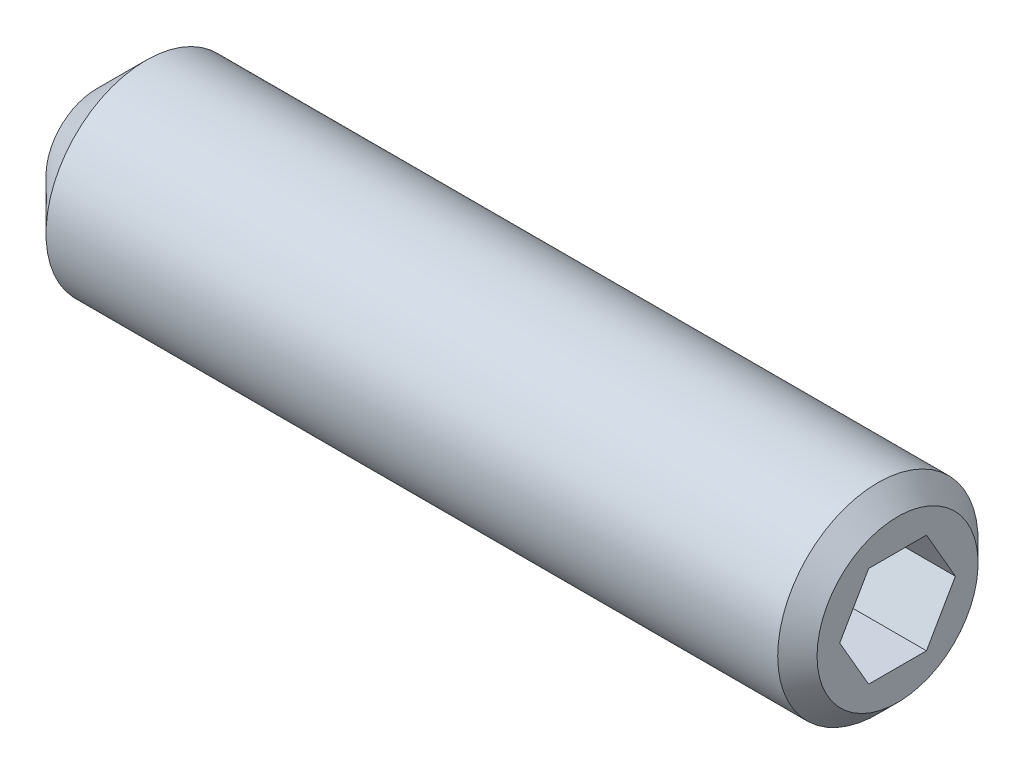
ISO-10303-21;
HEADER;
FILE_DESCRIPTION(('STEP AP214'),'2;1');
FILE_NAME('part.step','',(''),(''),'','','');
FILE_SCHEMA(('AUTOMOTIVE_DESIGN { 1 0 10303 214 1 1 1 1 }'));
ENDSEC;
DATA;
#1=APPLICATION_CONTEXT('core data for automotive mechanical design processes');
#2=APPLICATION_PROTOCOL_DEFINITION('international standard','automotive_design',2000,#1);
#3=PRODUCT_CONTEXT('',#1,'mechanical');
#4=PRODUCT('Part','Part','',(#3));
#5=PRODUCT_RELATED_PRODUCT_CATEGORY('part','',(#4));
#6=PRODUCT_DEFINITION_FORMATION('','',#4);
#7=PRODUCT_DEFINITION_CONTEXT('part definition',#1,'design');
#8=PRODUCT_DEFINITION('design','',#6,#7);
#9=PRODUCT_DEFINITION_SHAPE('','',#8);
#10=(LENGTH_UNIT() NAMED_UNIT(*) SI_UNIT(.MILLI.,.METRE.));
#11=(NAMED_UNIT(*) PLANE_ANGLE_UNIT() SI_UNIT($,.RADIAN.));
#12=(NAMED_UNIT(*) SI_UNIT($,.STERADIAN.) SOLID_ANGLE_UNIT());
#13=UNCERTAINTY_MEASURE_WITH_UNIT(LENGTH_MEASURE(1.E-05),#10,'distance_accuracy_value','');
#14=(GEOMETRIC_REPRESENTATION_CONTEXT(3) GLOBAL_UNCERTAINTY_ASSIGNED_CONTEXT((#13)) GLOBAL_UNIT_ASSIGNED_CONTEXT((#10,
#11,#12)) REPRESENTATION_CONTEXT('',''));
#15=CARTESIAN_POINT('',(0.,0.,0.));
#16=DIRECTION('',(0.,0.,1.));
#17=DIRECTION('',(1.,0.,0.));
#18=AXIS2_PLACEMENT_3D('',#15,#16,#17);
#19=CARTESIAN_POINT('',(20.,-1.25,-0.72168783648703));
#20=DIRECTION('',(0.,-0.5,-0.866025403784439));
#21=DIRECTION('',(0.,0.866025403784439,-0.5));
#22=AXIS2_PLACEMENT_3D('',#19,#20,#21);
#23=PLANE('',#22);
#24=DIRECTION('',(1.,0.,0.));
#25=VECTOR('',#24,1.);
#26=CARTESIAN_POINT('',(20.,-1.24999999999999,-0.72168783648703));
#27=LINE('',#26,#25);
#28=CARTESIAN_POINT('',(17.0000000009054,-1.24999999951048,-0.721687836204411));
#29=VERTEX_POINT('',#28);
#30=CARTESIAN_POINT('',(20.,-1.25,-0.72168783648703));
#31=VERTEX_POINT('',#30);
#32=EDGE_CURVE('E99',#29,#31,#27,.T.);
#33=ORIENTED_EDGE('',*,*,#32,.T.);
#34=DIRECTION('',(0.,0.866025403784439,-0.5));
#35=VECTOR('',#34,1.);
#36=CARTESIAN_POINT('',(20.,-1.25,-0.72168783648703));
#37=LINE('',#36,#35);
#38=CARTESIAN_POINT('',(20.,0.,-1.44337567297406));
#39=VERTEX_POINT('',#38);
#40=EDGE_CURVE('E81',#39,#31,#37,.F.);
#41=ORIENTED_EDGE('',*,*,#40,.F.);
#42=DIRECTION('',(1.,0.,0.));
#43=VECTOR('',#42,1.);
#44=CARTESIAN_POINT('',(20.,0.,-1.44337567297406));
#45=LINE('',#44,#43);
#46=CARTESIAN_POINT('',(17.0000000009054,0.,-1.44337567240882));
#47=VERTEX_POINT('',#46);
#48=EDGE_CURVE('E75',#39,#47,#45,.F.);
#49=ORIENTED_EDGE('',*,*,#48,.T.);
#50=DIRECTION('',(0.,-0.866025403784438,0.5));
#51=VECTOR('',#50,1.);
#52=CARTESIAN_POINT('',(17.,0.,-1.44337567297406));
#53=LINE('',#52,#51);
#54=EDGE_CURVE('E79',#47,#29,#53,.T.);
#55=ORIENTED_EDGE('',*,*,#54,.T.);
#56=EDGE_LOOP('',(#33,#41,#49,#55));
#57=FACE_BOUND('',#56,.T.);
#58=ADVANCED_FACE('F16',(#57),#23,.F.);
#59=CARTESIAN_POINT('',(17.,-0.654543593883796,-1.13370276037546));
#60=DIRECTION('',(1.,0.,0.));
#61=DIRECTION('',(0.,0.,-1.));
#62=AXIS2_PLACEMENT_3D('',#59,#60,#61);
#63=PLANE('',#62);
#64=CARTESIAN_POINT('',(17.0000000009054,0.,0.));
#65=DIRECTION('',(1.,0.,0.));
#66=DIRECTION('',(0.,0.,-1.));
#67=AXIS2_PLACEMENT_3D('',#64,#65,#66);
#68=CIRCLE('',#67,1.44337567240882);
#69=CARTESIAN_POINT('',(17.0000000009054,1.24999999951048,-0.721687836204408));
#70=VERTEX_POINT('',#69);
#71=EDGE_CURVE('E19',#70,#47,#68,.F.);
#72=ORIENTED_EDGE('',*,*,#71,.T.);
#73=DIRECTION('',(0.,0.866025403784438,0.5));
#74=VECTOR('',#73,1.);
#75=CARTESIAN_POINT('',(17.,0.,-1.44337567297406));
#76=LINE('',#75,#74);
#77=EDGE_CURVE('E69',#47,#70,#76,.T.);
#78=ORIENTED_EDGE('',*,*,#77,.T.);
#79=EDGE_LOOP('',(#72,#78));
#80=FACE_BOUND('',#79,.T.);
#81=ADVANCED_FACE('F101',(#80),#63,.F.);
#82=CARTESIAN_POINT('',(17.,-0.654543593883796,-1.13370276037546));
#83=DIRECTION('',(1.,0.,0.));
#84=DIRECTION('',(0.,0.,-1.));
#85=AXIS2_PLACEMENT_3D('',#82,#83,#84);
#86=PLANE('',#85);
#87=CARTESIAN_POINT('',(17.0000000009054,0.,0.));
#88=DIRECTION('',(1.,0.,0.));
#89=DIRECTION('',(0.,0.,-1.));
#90=AXIS2_PLACEMENT_3D('',#87,#88,#89);
#91=CIRCLE('',#90,1.44337567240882);
#92=EDGE_CURVE('E90',#47,#29,#91,.F.);
#93=ORIENTED_EDGE('',*,*,#92,.T.);
#94=ORIENTED_EDGE('',*,*,#54,.F.);
#95=EDGE_LOOP('',(#93,#94));
#96=FACE_BOUND('',#95,.T.);
#97=ADVANCED_FACE('F98',(#96),#86,.F.);
#98=CARTESIAN_POINT('',(17.,-0.654543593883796,-1.13370276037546));
#99=DIRECTION('',(1.,0.,0.));
#100=DIRECTION('',(0.,0.,-1.));
#101=AXIS2_PLACEMENT_3D('',#98,#99,#100);
#102=PLANE('',#101);
#103=CARTESIAN_POINT('',(17.0000000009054,0.,0.));
#104=DIRECTION('',(1.,0.,0.));
#105=DIRECTION('',(0.,0.,-1.));
#106=AXIS2_PLACEMENT_3D('',#103,#104,#105);
#107=CIRCLE('',#106,1.44337567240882);
#108=CARTESIAN_POINT('',(17.0000000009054,-1.24999999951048,0.721687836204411));
#109=VERTEX_POINT('',#108);
#110=EDGE_CURVE('E95',#29,#109,#107,.F.);
#111=ORIENTED_EDGE('',*,*,#110,.T.);
#112=DIRECTION('',(0.,0.,-1.));
#113=VECTOR('',#112,1.);
#114=CARTESIAN_POINT('',(17.,-1.24999999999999,0.721687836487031));
#115=LINE('',#114,#113);
#116=EDGE_CURVE('E111',#109,#29,#115,.T.);
#117=ORIENTED_EDGE('',*,*,#116,.T.);
#118=EDGE_LOOP('',(#111,#117));
#119=FACE_BOUND('',#118,.T.);
#120=ADVANCED_FACE('F134',(#119),#102,.F.);
#121=CARTESIAN_POINT('',(20.,-1.24999999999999,0.721687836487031));
#122=DIRECTION('',(0.,-1.,0.));
#123=DIRECTION('',(0.,0.,-1.));
#124=AXIS2_PLACEMENT_3D('',#121,#122,#123);
#125=PLANE('',#124);
#126=DIRECTION('',(1.,0.,0.));
#127=VECTOR('',#126,1.);
#128=CARTESIAN_POINT('',(20.,-1.25,0.721687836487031));
#129=LINE('',#128,#127);
#130=CARTESIAN_POINT('',(20.,-1.25,0.721687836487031));
#131=VERTEX_POINT('',#130);
#132=EDGE_CURVE('E112',#109,#131,#129,.T.);
#133=ORIENTED_EDGE('',*,*,#132,.T.);
#134=DIRECTION('',(0.,0.,-1.));
#135=VECTOR('',#134,1.);
#136=CARTESIAN_POINT('',(20.,-1.24999999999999,0.721687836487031));
#137=LINE('',#136,#135);
#138=EDGE_CURVE('E117',#31,#131,#137,.F.);
#139=ORIENTED_EDGE('',*,*,#138,.F.);
#140=ORIENTED_EDGE('',*,*,#32,.F.);
#141=ORIENTED_EDGE('',*,*,#116,.F.);
#142=EDGE_LOOP('',(#133,#139,#140,#141));
#143=FACE_BOUND('',#142,.T.);
#144=ADVANCED_FACE('F148',(#143),#125,.F.);
#145=CARTESIAN_POINT('',(17.,-0.654543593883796,-1.13370276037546));
#146=DIRECTION('',(1.,0.,0.));
#147=DIRECTION('',(0.,0.,-1.));
#148=AXIS2_PLACEMENT_3D('',#145,#146,#147);
#149=PLANE('',#148);
#150=CARTESIAN_POINT('',(17.0000000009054,0.,0.));
#151=DIRECTION('',(1.,0.,0.));
#152=DIRECTION('',(0.,0.,-1.));
#153=AXIS2_PLACEMENT_3D('',#150,#151,#152);
#154=CIRCLE('',#153,1.44337567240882);
#155=CARTESIAN_POINT('',(17.0000000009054,0.,1.44337567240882));
#156=VERTEX_POINT('',#155);
#157=EDGE_CURVE('E130',#109,#156,#154,.F.);
#158=ORIENTED_EDGE('',*,*,#157,.T.);
#159=DIRECTION('',(0.,-0.866025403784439,-0.5));
#160=VECTOR('',#159,1.);
#161=CARTESIAN_POINT('',(17.,0.,1.44337567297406));
#162=LINE('',#161,#160);
#163=EDGE_CURVE('E140',#156,#109,#162,.T.);
#164=ORIENTED_EDGE('',*,*,#163,.T.);
#165=EDGE_LOOP('',(#158,#164));
#166=FACE_BOUND('',#165,.T.);
#167=ADVANCED_FACE('F145',(#166),#149,.F.);
#168=CARTESIAN_POINT('',(20.,0.,-1.44337567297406));
#169=DIRECTION('',(0.,0.5,-0.866025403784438));
#170=DIRECTION('',(0.,0.866025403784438,0.5));
#171=AXIS2_PLACEMENT_3D('',#168,#169,#170);
#172=PLANE('',#171);
#173=ORIENTED_EDGE('',*,*,#48,.F.);
#174=DIRECTION('',(0.,0.866025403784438,0.5));
#175=VECTOR('',#174,1.);
#176=CARTESIAN_POINT('',(20.,0.,-1.44337567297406));
#177=LINE('',#176,#175);
#178=CARTESIAN_POINT('',(20.,1.25,-0.721687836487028));
#179=VERTEX_POINT('',#178);
#180=EDGE_CURVE('E84',#179,#39,#177,.F.);
#181=ORIENTED_EDGE('',*,*,#180,.F.);
#182=DIRECTION('',(1.,0.,0.));
#183=VECTOR('',#182,1.);
#184=CARTESIAN_POINT('',(20.,1.25,-0.721687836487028));
#185=LINE('',#184,#183);
#186=EDGE_CURVE('E105',#179,#70,#185,.F.);
#187=ORIENTED_EDGE('',*,*,#186,.T.);
#188=ORIENTED_EDGE('',*,*,#77,.F.);
#189=EDGE_LOOP('',(#173,#181,#187,#188));
#190=FACE_BOUND('',#189,.T.);
#191=ADVANCED_FACE('F103',(#190),#172,.F.);
#192=CARTESIAN_POINT('',(17.,-0.654543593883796,-1.13370276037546));
#193=DIRECTION('',(1.,0.,0.));
#194=DIRECTION('',(0.,0.,-1.));
#195=AXIS2_PLACEMENT_3D('',#192,#193,#194);
#196=PLANE('',#195);
#197=CARTESIAN_POINT('',(17.0000000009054,0.,0.));
#198=DIRECTION('',(1.,0.,0.));
#199=DIRECTION('',(0.,0.,-1.));
#200=AXIS2_PLACEMENT_3D('',#197,#198,#199);
#201=CIRCLE('',#200,1.44337567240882);
#202=CARTESIAN_POINT('',(17.0000000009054,1.24999999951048,0.72168783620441));
#203=VERTEX_POINT('',#202);
#204=EDGE_CURVE('E115',#203,#70,#201,.F.);
#205=ORIENTED_EDGE('',*,*,#204,.T.);
#206=DIRECTION('',(0.,0.,1.));
#207=VECTOR('',#206,1.);
#208=CARTESIAN_POINT('',(17.,1.25,-0.721687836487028));
#209=LINE('',#208,#207);
#210=EDGE_CURVE('E128',#70,#203,#209,.T.);
#211=ORIENTED_EDGE('',*,*,#210,.T.);
#212=EDGE_LOOP('',(#205,#211));
#213=FACE_BOUND('',#212,.T.);
#214=ADVANCED_FACE('F175',(#213),#196,.F.);
#215=CARTESIAN_POINT('',(17.0000000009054,0.,0.));
#216=DIRECTION('',(1.,0.,0.));
#217=DIRECTION('',(0.,0.,-1.));
#218=AXIS2_PLACEMENT_3D('',#215,#216,#217);
#219=CONICAL_SURFACE('',#218,1.44337567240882,1.04719754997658);
#220=CARTESIAN_POINT('',(16.1666666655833,-5.6843418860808E-11,0.));
#221=VERTEX_POINT('',#220);
#222=VERTEX_LOOP('',#221);
#223=FACE_BOUND('',#222,.T.);
#224=CARTESIAN_POINT('',(17.0000000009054,0.,0.));
#225=DIRECTION('',(1.,0.,0.));
#226=DIRECTION('',(0.,0.,-1.));
#227=AXIS2_PLACEMENT_3D('',#224,#225,#226);
#228=CIRCLE('',#227,1.44337567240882);
#229=EDGE_CURVE('E125',#203,#156,#228,.T.);
#230=ORIENTED_EDGE('',*,*,#229,.T.);
#231=ORIENTED_EDGE('',*,*,#157,.F.);
#232=ORIENTED_EDGE('',*,*,#110,.F.);
#233=ORIENTED_EDGE('',*,*,#92,.F.);
#234=ORIENTED_EDGE('',*,*,#71,.F.);
#235=ORIENTED_EDGE('',*,*,#204,.F.);
#236=EDGE_LOOP('',(#230,#231,#232,#233,#234,#235));
#237=FACE_BOUND('',#236,.T.);
#238=ADVANCED_FACE('F92',(#223,#237),#219,.F.);
#239=CARTESIAN_POINT('',(20.,0.,1.44337567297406));
#240=DIRECTION('',(0.,-0.5,0.866025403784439));
#241=DIRECTION('',(0.,-0.866025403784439,-0.5));
#242=AXIS2_PLACEMENT_3D('',#239,#240,#241);
#243=PLANE('',#242);
#244=DIRECTION('',(1.,0.,0.));
#245=VECTOR('',#244,1.);
#246=CARTESIAN_POINT('',(20.,0.,1.44337567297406));
#247=LINE('',#246,#245);
#248=CARTESIAN_POINT('',(20.,0.,1.44337567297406));
#249=VERTEX_POINT('',#248);
#250=EDGE_CURVE('E127',#156,#249,#247,.T.);
#251=ORIENTED_EDGE('',*,*,#250,.T.);
#252=DIRECTION('',(0.,-0.866025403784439,-0.5));
#253=VECTOR('',#252,1.);
#254=CARTESIAN_POINT('',(20.,0.,1.44337567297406));
#255=LINE('',#254,#253);
#256=EDGE_CURVE('E34',#131,#249,#255,.F.);
#257=ORIENTED_EDGE('',*,*,#256,.F.);
#258=ORIENTED_EDGE('',*,*,#132,.F.);
#259=ORIENTED_EDGE('',*,*,#163,.F.);
#260=EDGE_LOOP('',(#251,#257,#258,#259));
#261=FACE_BOUND('',#260,.T.);
#262=ADVANCED_FACE('F139',(#261),#243,.F.);
#263=CARTESIAN_POINT('',(20.,1.25,-0.721687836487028));
#264=DIRECTION('',(0.,1.,0.));
#265=DIRECTION('',(0.,0.,1.));
#266=AXIS2_PLACEMENT_3D('',#263,#264,#265);
#267=PLANE('',#266);
#268=ORIENTED_EDGE('',*,*,#186,.F.);
#269=DIRECTION('',(0.,0.,1.));
#270=VECTOR('',#269,1.);
#271=CARTESIAN_POINT('',(20.,1.25,-0.721687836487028));
#272=LINE('',#271,#270);
#273=CARTESIAN_POINT('',(20.,1.25,0.721687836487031));
#274=VERTEX_POINT('',#273);
#275=EDGE_CURVE('E146',#274,#179,#272,.F.);
#276=ORIENTED_EDGE('',*,*,#275,.F.);
#277=DIRECTION('',(1.,0.,0.));
#278=VECTOR('',#277,1.);
#279=CARTESIAN_POINT('',(20.,1.25,0.721687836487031));
#280=LINE('',#279,#278);
#281=EDGE_CURVE('E160',#274,#203,#280,.F.);
#282=ORIENTED_EDGE('',*,*,#281,.T.);
#283=ORIENTED_EDGE('',*,*,#210,.F.);
#284=EDGE_LOOP('',(#268,#276,#282,#283));
#285=FACE_BOUND('',#284,.T.);
#286=ADVANCED_FACE('F173',(#285),#267,.F.);
#287=CARTESIAN_POINT('',(17.,-0.654543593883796,-1.13370276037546));
#288=DIRECTION('',(1.,0.,0.));
#289=DIRECTION('',(0.,0.,-1.));
#290=AXIS2_PLACEMENT_3D('',#287,#288,#289);
#291=PLANE('',#290);
#292=ORIENTED_EDGE('',*,*,#229,.F.);
#293=DIRECTION('',(0.,-0.866025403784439,0.5));
#294=VECTOR('',#293,1.);
#295=CARTESIAN_POINT('',(17.,1.25,0.721687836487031));
#296=LINE('',#295,#294);
#297=EDGE_CURVE('E154',#203,#156,#296,.T.);
#298=ORIENTED_EDGE('',*,*,#297,.T.);
#299=EDGE_LOOP('',(#292,#298));
#300=FACE_BOUND('',#299,.T.);
#301=ADVANCED_FACE('F153',(#300),#291,.F.);
#302=CARTESIAN_POINT('',(20.,1.25,0.721687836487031));
#303=DIRECTION('',(0.,0.5,0.866025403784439));
#304=DIRECTION('',(0.,-0.866025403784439,0.5));
#305=AXIS2_PLACEMENT_3D('',#302,#303,#304);
#306=PLANE('',#305);
#307=ORIENTED_EDGE('',*,*,#281,.F.);
#308=DIRECTION('',(0.,0.866025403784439,-0.5));
#309=VECTOR('',#308,1.);
#310=CARTESIAN_POINT('',(20.,0.,1.44337567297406));
#311=LINE('',#310,#309);
#312=EDGE_CURVE('E161',#249,#274,#311,.T.);
#313=ORIENTED_EDGE('',*,*,#312,.F.);
#314=ORIENTED_EDGE('',*,*,#250,.F.);
#315=ORIENTED_EDGE('',*,*,#297,.F.);
#316=EDGE_LOOP('',(#307,#313,#314,#315));
#317=FACE_BOUND('',#316,.T.);
#318=ADVANCED_FACE('F158',(#317),#306,.F.);
#319=CARTESIAN_POINT('',(-7.38964418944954E-10,0.,0.));
#320=DIRECTION('',(-1.,0.,0.));
#321=DIRECTION('',(0.,-1.,0.));
#322=AXIS2_PLACEMENT_3D('',#319,#320,#321);
#323=CONICAL_SURFACE('',#322,1.24999999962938,1.04719754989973);
#324=CARTESIAN_POINT('',(0.721687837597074,-1.70530256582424E-10,0.));
#325=VERTEX_POINT('',#324);
#326=VERTEX_LOOP('',#325);
#327=FACE_BOUND('',#326,.T.);
#328=CARTESIAN_POINT('',(-5.6843418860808E-10,0.,0.));
#329=DIRECTION('',(1.,0.,0.));
#330=DIRECTION('',(0.,-1.,0.));
#331=AXIS2_PLACEMENT_3D('',#328,#329,#330);
#332=CIRCLE('',#331,1.25000000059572);
#333=CARTESIAN_POINT('',(-5.6843418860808E-10,-1.25000000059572,0.));
#334=VERTEX_POINT('',#333);
#335=EDGE_CURVE('E124',#334,#334,#332,.T.);
#336=ORIENTED_EDGE('',*,*,#335,.F.);
#337=EDGE_LOOP('',(#336));
#338=FACE_BOUND('',#337,.T.);
#339=ADVANCED_FACE('F204',(#327,#338),#323,.F.);
#340=CARTESIAN_POINT('',(20.,1.97168783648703,0.));
#341=DIRECTION('',(1.,0.,0.));
#342=DIRECTION('',(0.,0.,-1.));
#343=AXIS2_PLACEMENT_3D('',#340,#341,#342);
#344=PLANE('',#343);
#345=ORIENTED_EDGE('',*,*,#256,.T.);
#346=ORIENTED_EDGE('',*,*,#312,.T.);
#347=ORIENTED_EDGE('',*,*,#275,.T.);
#348=ORIENTED_EDGE('',*,*,#180,.T.);
#349=ORIENTED_EDGE('',*,*,#40,.T.);
#350=ORIENTED_EDGE('',*,*,#138,.T.);
#351=EDGE_LOOP('',(#345,#346,#347,#348,#349,#350));
#352=FACE_BOUND('',#351,.T.);
#353=CARTESIAN_POINT('',(20.000000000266,0.,0.));
#354=DIRECTION('',(-1.,0.,0.));
#355=DIRECTION('',(0.,0.,1.));
#356=AXIS2_PLACEMENT_3D('',#353,#354,#355);
#357=CIRCLE('',#356,2.00924000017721);
#358=CARTESIAN_POINT('',(20.000000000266,0.,2.00924000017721));
#359=VERTEX_POINT('',#358);
#360=EDGE_CURVE('E121',#359,#359,#357,.T.);
#361=ORIENTED_EDGE('',*,*,#360,.F.);
#362=EDGE_LOOP('',(#361));
#363=FACE_BOUND('',#362,.T.);
#364=ADVANCED_FACE('F169',(#352,#363),#344,.T.);
#365=CARTESIAN_POINT('',(1.25000000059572,0.,0.));
#366=DIRECTION('',(1.,0.,0.));
#367=DIRECTION('',(0.,0.,-1.));
#368=AXIS2_PLACEMENT_3D('',#365,#366,#367);
#369=CONICAL_SURFACE('',#368,2.49999999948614,0.785398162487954);
#370=CARTESIAN_POINT('',(1.25,0.,0.));
#371=DIRECTION('',(1.,0.,0.));
#372=DIRECTION('',(0.,1.,0.));
#373=AXIS2_PLACEMENT_3D('',#370,#371,#372);
#374=CIRCLE('',#373,2.5);
#375=CARTESIAN_POINT('',(1.25,2.5,0.));
#376=VERTEX_POINT('',#375);
#377=EDGE_CURVE('E25',#376,#376,#374,.T.);
#378=ORIENTED_EDGE('',*,*,#377,.F.);
#379=EDGE_LOOP('',(#378));
#380=FACE_BOUND('',#379,.T.);
#381=ORIENTED_EDGE('',*,*,#335,.T.);
#382=EDGE_LOOP('',(#381));
#383=FACE_BOUND('',#382,.T.);
#384=ADVANCED_FACE('F194',(#380,#383),#369,.T.);
#385=CARTESIAN_POINT('',(19.5092399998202,0.,0.));
#386=DIRECTION('',(-1.,0.,0.));
#387=DIRECTION('',(0.,0.,1.));
#388=AXIS2_PLACEMENT_3D('',#385,#386,#387);
#389=CONICAL_SURFACE('',#388,2.49999999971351,0.78539816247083);
#390=ORIENTED_EDGE('',*,*,#360,.T.);
#391=EDGE_LOOP('',(#390));
#392=FACE_BOUND('',#391,.T.);
#393=CARTESIAN_POINT('',(19.50924,0.,0.));
#394=DIRECTION('',(1.,0.,0.));
#395=DIRECTION('',(0.,1.,0.));
#396=AXIS2_PLACEMENT_3D('',#393,#394,#395);
#397=CIRCLE('',#396,2.5);
#398=CARTESIAN_POINT('',(19.50924,2.5,0.));
#399=VERTEX_POINT('',#398);
#400=EDGE_CURVE('E11',#399,#399,#397,.F.);
#401=ORIENTED_EDGE('',*,*,#400,.F.);
#402=EDGE_LOOP('',(#401));
#403=FACE_BOUND('',#402,.T.);
#404=ADVANCED_FACE('F188',(#392,#403),#389,.T.);
#405=CARTESIAN_POINT('',(10.,0.,0.));
#406=DIRECTION('',(1.,0.,0.));
#407=DIRECTION('',(0.,1.,0.));
#408=AXIS2_PLACEMENT_3D('',#405,#406,#407);
#409=CYLINDRICAL_SURFACE('',#408,2.5);
#410=ORIENTED_EDGE('',*,*,#400,.T.);
#411=EDGE_LOOP('',(#410));
#412=FACE_BOUND('',#411,.T.);
#413=ORIENTED_EDGE('',*,*,#377,.T.);
#414=EDGE_LOOP('',(#413));
#415=FACE_BOUND('',#414,.T.);
#416=ADVANCED_FACE('F186',(#412,#415),#409,.T.);
#417=CLOSED_SHELL('',(#58,#81,#97,#120,#144,#167,#191,#214,#238,#262,#286,#301,#318,#339,#364,
#384,#404,#416));
#418=MANIFOLD_SOLID_BREP('B1',#417);
#419=ADVANCED_BREP_SHAPE_REPRESENTATION('',(#18,#418),#14);
#420=SHAPE_DEFINITION_REPRESENTATION(#9,#419);
ENDSEC;
END-ISO-10303-21;
